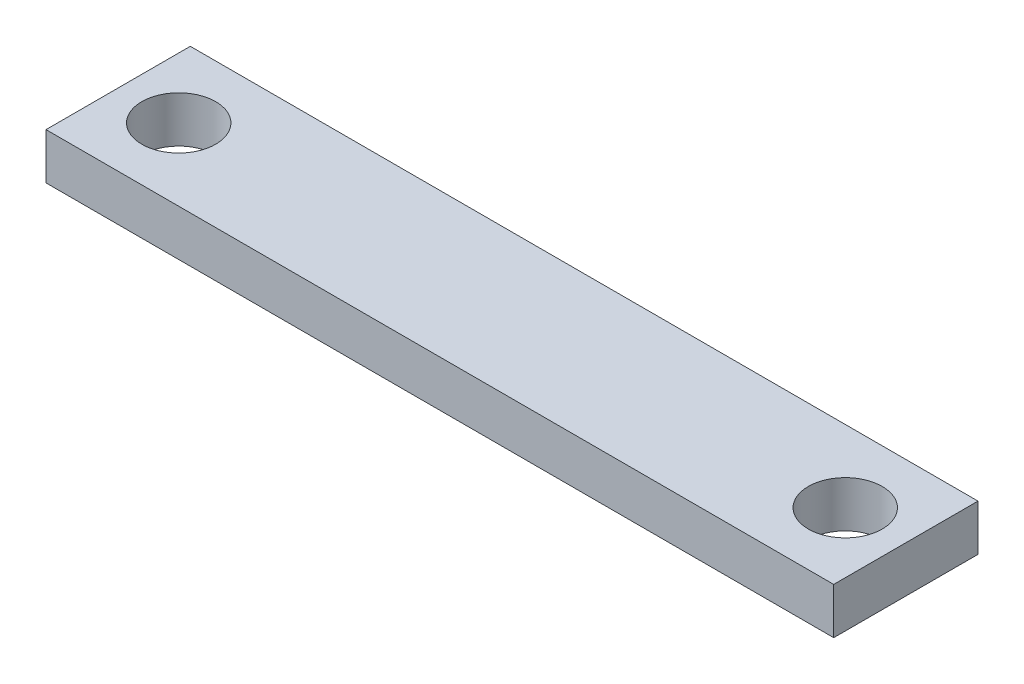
from build123d import *

# Parameters (mm, degrees)
SKETCH1_W             = 26
SKETCH1_H             = 4.7625
BOSS_EXTRUDE1_DEPTH   = 1.524
F_2_CLEARANCE_HOLE1_D = 2.4384


with BuildPart() as part:
    # Sketch1 → Boss-Extrude1 (new body)
    with BuildSketch(Plane(origin=(0, 0, 0), x_dir=(1, 0, 0), z_dir=(0, 1, 0))):
        Rectangle(SKETCH1_W, SKETCH1_H)
    extrude(amount=BOSS_EXTRUDE1_DEPTH)

    # 2 Clearance Hole1 (through all)
    with Locations(Plane(origin=(0, 1.524, 0), x_dir=(1, 0, 0), z_dir=(0, 1, 0))):
        with Locations((-11, 0), (11, 0)):
            Hole(F_2_CLEARANCE_HOLE1_D / 2)


solid = part.part
